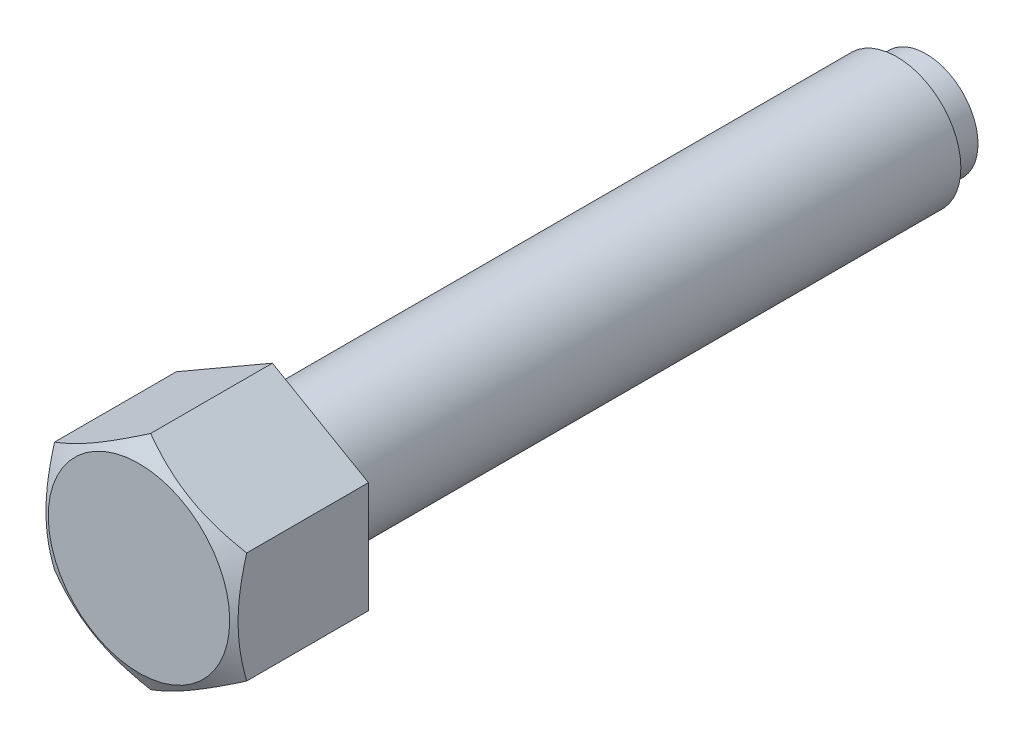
ISO-10303-21;
HEADER;
FILE_DESCRIPTION(('STEP AP214'),'2;1');
FILE_NAME('part.step','',(''),(''),'','','');
FILE_SCHEMA(('AUTOMOTIVE_DESIGN { 1 0 10303 214 1 1 1 1 }'));
ENDSEC;
DATA;
#1=APPLICATION_CONTEXT('core data for automotive mechanical design processes');
#2=APPLICATION_PROTOCOL_DEFINITION('international standard','automotive_design',2000,#1);
#3=PRODUCT_CONTEXT('',#1,'mechanical');
#4=PRODUCT('Part','Part','',(#3));
#5=PRODUCT_RELATED_PRODUCT_CATEGORY('part','',(#4));
#6=PRODUCT_DEFINITION_FORMATION('','',#4);
#7=PRODUCT_DEFINITION_CONTEXT('part definition',#1,'design');
#8=PRODUCT_DEFINITION('design','',#6,#7);
#9=PRODUCT_DEFINITION_SHAPE('','',#8);
#10=(LENGTH_UNIT() NAMED_UNIT(*) SI_UNIT(.MILLI.,.METRE.));
#11=(NAMED_UNIT(*) PLANE_ANGLE_UNIT() SI_UNIT($,.RADIAN.));
#12=(NAMED_UNIT(*) SI_UNIT($,.STERADIAN.) SOLID_ANGLE_UNIT());
#13=UNCERTAINTY_MEASURE_WITH_UNIT(LENGTH_MEASURE(1.E-05),#10,'distance_accuracy_value','');
#14=(GEOMETRIC_REPRESENTATION_CONTEXT(3) GLOBAL_UNCERTAINTY_ASSIGNED_CONTEXT((#13)) GLOBAL_UNIT_ASSIGNED_CONTEXT((#10,
#11,#12)) REPRESENTATION_CONTEXT('',''));
#15=CARTESIAN_POINT('',(0.,0.,0.));
#16=DIRECTION('',(0.,0.,1.));
#17=DIRECTION('',(1.,0.,0.));
#18=AXIS2_PLACEMENT_3D('',#15,#16,#17);
#19=CARTESIAN_POINT('',(0.,20.7846096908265,120.));
#20=DIRECTION('',(-0.5,-0.86602540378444,0.));
#21=DIRECTION('',(0.86602540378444,-0.5,0.));
#22=AXIS2_PLACEMENT_3D('',#19,#20,#21);
#23=PLANE('',#22);
#24=CARTESIAN_POINT('',(18.0002,10.3921893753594,147.814887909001));
#25=CARTESIAN_POINT('',(17.6045674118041,10.6206079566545,147.946756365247));
#26=CARTESIAN_POINT('',(17.2073916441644,10.8499174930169,148.072640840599));
#27=CARTESIAN_POINT('',(16.4098552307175,11.310375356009,148.310778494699));
#28=CARTESIAN_POINT('',(16.0094935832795,11.5415242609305,148.423027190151));
#29=CARTESIAN_POINT('',(15.2048116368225,12.0061075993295,148.632384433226));
#30=CARTESIAN_POINT('',(14.8004842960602,12.2395460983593,148.729457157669));
#31=CARTESIAN_POINT('',(13.9890201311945,12.7080451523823,148.906377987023));
#32=CARTESIAN_POINT('',(13.5818834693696,12.9431056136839,148.98622707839));
#33=CARTESIAN_POINT('',(12.7752328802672,13.4088255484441,149.125304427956));
#34=CARTESIAN_POINT('',(12.3757788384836,13.6394504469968,149.184993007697));
#35=CARTESIAN_POINT('',(11.5750403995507,14.1017570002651,149.285077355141));
#36=CARTESIAN_POINT('',(11.1737559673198,14.3334386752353,149.325472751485));
#37=CARTESIAN_POINT('',(10.370513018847,14.7971912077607,149.385950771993));
#38=CARTESIAN_POINT('',(9.96855587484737,15.0292612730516,149.406057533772));
#39=CARTESIAN_POINT('',(9.16427056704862,15.4936156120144,149.425525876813));
#40=CARTESIAN_POINT('',(8.76194241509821,15.7258998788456,149.424888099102));
#41=CARTESIAN_POINT('',(8.00978065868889,16.1601606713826,149.404316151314));
#42=CARTESIAN_POINT('',(7.65989346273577,16.3621681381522,149.38689054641));
#43=CARTESIAN_POINT('',(6.96095368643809,16.765701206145,149.336680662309));
#44=CARTESIAN_POINT('',(6.61190109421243,16.9672268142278,149.303896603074));
#45=CARTESIAN_POINT('',(5.91476277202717,17.3697198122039,149.223538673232));
#46=CARTESIAN_POINT('',(5.56667820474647,17.5706865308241,149.175951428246));
#47=CARTESIAN_POINT('',(4.87216610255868,17.9716632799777,149.066826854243));
#48=CARTESIAN_POINT('',(4.52573856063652,18.1716733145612,149.005289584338));
#49=CARTESIAN_POINT('',(3.47411308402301,18.7788295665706,148.798187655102));
#50=CARTESIAN_POINT('',(2.77196054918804,19.1842175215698,148.631972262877));
#51=CARTESIAN_POINT('',(1.37812528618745,19.9889486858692,148.254731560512));
#52=CARTESIAN_POINT('',(0.686424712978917,20.3883021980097,148.043794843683));
#53=CARTESIAN_POINT('',(-0.000199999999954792,20.7847251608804,147.814887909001));
#54=B_SPLINE_CURVE_WITH_KNOTS('',3,(#24,#25,#26,#27,#28,#29,#30,#31,#32,#33,#34,#35,#36,#37,#38,
#39,#40,#41,#42,#43,#44,#45,#46,#47,#48,#49,#50,#51,#52,#53),.UNSPECIFIED.,.F.,.F.,(4,2,2,2,2,2,
2,2,2,2,2,2,2,2,4),(0.,1.42650335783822,2.85347447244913,4.28376471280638,5.71397301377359,
7.10888071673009,8.50381526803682,9.89708828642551,11.2903182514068,12.5031974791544,
13.7160593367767,14.9300201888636,16.1439758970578,18.6253607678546,21.1018751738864),.UNSPECIFIED.);
#55=CARTESIAN_POINT('',(18.,10.3923048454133,147.814954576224));
#56=VERTEX_POINT('',#55);
#57=CARTESIAN_POINT('',(0.,20.7846096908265,147.814954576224));
#58=VERTEX_POINT('',#57);
#59=EDGE_CURVE('E29',#56,#58,#54,.T.);
#60=ORIENTED_EDGE('',*,*,#59,.F.);
#61=DIRECTION('',(0.,0.,1.));
#62=VECTOR('',#61,1.);
#63=CARTESIAN_POINT('',(18.,10.3923048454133,120.));
#64=LINE('',#63,#62);
#65=CARTESIAN_POINT('',(18.,10.3923048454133,125.));
#66=VERTEX_POINT('',#65);
#67=EDGE_CURVE('E96',#66,#56,#64,.T.);
#68=ORIENTED_EDGE('',*,*,#67,.F.);
#69=DIRECTION('',(0.86602540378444,-0.5,0.));
#70=VECTOR('',#69,1.);
#71=CARTESIAN_POINT('',(18.,10.3923048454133,125.));
#72=LINE('',#71,#70);
#73=CARTESIAN_POINT('',(0.,20.7846096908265,125.));
#74=VERTEX_POINT('',#73);
#75=EDGE_CURVE('E110',#74,#66,#72,.T.);
#76=ORIENTED_EDGE('',*,*,#75,.F.);
#77=DIRECTION('',(0.,0.,1.));
#78=VECTOR('',#77,1.);
#79=CARTESIAN_POINT('',(0.,20.7846096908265,120.));
#80=LINE('',#79,#78);
#81=EDGE_CURVE('E36',#74,#58,#80,.T.);
#82=ORIENTED_EDGE('',*,*,#81,.T.);
#83=EDGE_LOOP('',(#60,#68,#76,#82));
#84=FACE_BOUND('',#83,.T.);
#85=ADVANCED_FACE('F14',(#84),#23,.F.);
#86=CARTESIAN_POINT('',(18.,10.3923048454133,120.));
#87=DIRECTION('',(-1.,0.,0.));
#88=DIRECTION('',(0.,-1.,0.));
#89=AXIS2_PLACEMENT_3D('',#86,#87,#88);
#90=PLANE('',#89);
#91=CARTESIAN_POINT('',(18.,-27.7856705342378,140.700880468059));
#92=CARTESIAN_POINT('',(18.,-27.3931265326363,140.891087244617));
#93=CARTESIAN_POINT('',(18.,-27.00011837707,141.08033565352));
#94=CARTESIAN_POINT('',(18.,-26.2130768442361,141.456698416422));
#95=CARTESIAN_POINT('',(18.,-25.8190434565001,141.643812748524));
#96=CARTESIAN_POINT('',(18.,-24.6351533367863,142.201678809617));
#97=CARTESIAN_POINT('',(18.,-23.8436247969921,142.568896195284));
#98=CARTESIAN_POINT('',(18.,-22.2508574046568,143.293665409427));
#99=CARTESIAN_POINT('',(18.,-21.4495890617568,143.65115258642));
#100=CARTESIAN_POINT('',(18.,-19.8406345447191,144.351328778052));
#101=CARTESIAN_POINT('',(18.,-19.0329486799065,144.694018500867));
#102=CARTESIAN_POINT('',(18.,-17.384335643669,145.37116922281));
#103=CARTESIAN_POINT('',(18.,-16.5431617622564,145.705032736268));
#104=CARTESIAN_POINT('',(18.,-14.8509192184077,146.347178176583));
#105=CARTESIAN_POINT('',(18.,-13.9998494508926,146.655457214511));
#106=CARTESIAN_POINT('',(18.,-12.2881243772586,147.238241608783));
#107=CARTESIAN_POINT('',(18.,-11.4274929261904,147.512816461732));
#108=CARTESIAN_POINT('',(18.,-9.69380398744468,148.019311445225));
#109=CARTESIAN_POINT('',(18.,-8.82075054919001,148.251245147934));
#110=CARTESIAN_POINT('',(18.,-7.50411166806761,148.558078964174));
#111=CARTESIAN_POINT('',(18.,-7.0652351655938,148.653312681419));
#112=CARTESIAN_POINT('',(18.,-6.18450790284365,148.828942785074));
#113=CARTESIAN_POINT('',(18.,-5.74265720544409,148.909339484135));
#114=CARTESIAN_POINT('',(18.,-4.85630346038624,149.053867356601));
#115=CARTESIAN_POINT('',(18.,-4.41180049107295,149.117999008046));
#116=CARTESIAN_POINT('',(18.,-3.52059947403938,149.228716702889));
#117=CARTESIAN_POINT('',(18.,-3.07390142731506,149.275302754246));
#118=CARTESIAN_POINT('',(18.,-2.18473533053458,149.34942269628));
#119=CARTESIAN_POINT('',(18.,-1.7422872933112,149.377195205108));
#120=CARTESIAN_POINT('',(18.,-0.856614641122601,149.414013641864));
#121=CARTESIAN_POINT('',(18.,-0.413390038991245,149.423059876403));
#122=CARTESIAN_POINT('',(18.,0.473047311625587,149.422211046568));
#123=CARTESIAN_POINT('',(18.,0.916260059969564,149.412315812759));
#124=CARTESIAN_POINT('',(18.,1.80187706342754,149.373823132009));
#125=CARTESIAN_POINT('',(18.,2.24428128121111,149.34522484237));
#126=CARTESIAN_POINT('',(18.,3.31144318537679,149.254283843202));
#127=CARTESIAN_POINT('',(18.,3.93543941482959,149.182849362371));
#128=CARTESIAN_POINT('',(18.,5.17871898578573,149.006693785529));
#129=CARTESIAN_POINT('',(18.,5.79800165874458,148.901968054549));
#130=CARTESIAN_POINT('',(18.,7.03129105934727,148.662955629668));
#131=CARTESIAN_POINT('',(18.,7.64529320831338,148.528645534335));
#132=CARTESIAN_POINT('',(18.,8.86709871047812,148.234555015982));
#133=CARTESIAN_POINT('',(18.,9.4749021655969,148.074775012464));
#134=CARTESIAN_POINT('',(18.,10.6976432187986,147.729857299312));
#135=CARTESIAN_POINT('',(18.,11.3124445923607,147.544239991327));
#136=CARTESIAN_POINT('',(18.,12.5359892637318,147.154110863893));
#137=CARTESIAN_POINT('',(18.,13.1447325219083,146.949598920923));
#138=CARTESIAN_POINT('',(18.,14.3564672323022,146.524902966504));
#139=CARTESIAN_POINT('',(18.,14.9594605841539,146.30472434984));
#140=CARTESIAN_POINT('',(18.,16.1604691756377,145.851257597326));
#141=CARTESIAN_POINT('',(18.,16.7584844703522,145.617969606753));
#142=CARTESIAN_POINT('',(18.,18.1568432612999,145.05762073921));
#143=CARTESIAN_POINT('',(18.,18.9553996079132,144.726106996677));
#144=CARTESIAN_POINT('',(18.,20.5458499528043,144.047421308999));
#145=CARTESIAN_POINT('',(18.,21.3377435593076,143.700248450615));
#146=CARTESIAN_POINT('',(18.,22.9160943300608,142.993347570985));
#147=CARTESIAN_POINT('',(18.,23.7025503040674,142.633616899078));
#148=CARTESIAN_POINT('',(18.,25.2707564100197,141.904105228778));
#149=CARTESIAN_POINT('',(18.,26.0525066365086,141.534324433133));
#150=CARTESIAN_POINT('',(18.,27.6128949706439,140.786178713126));
#151=CARTESIAN_POINT('',(18.,28.3915289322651,140.407805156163));
#152=CARTESIAN_POINT('',(18.,29.9454784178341,139.644305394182));
#153=CARTESIAN_POINT('',(18.,30.7207939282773,139.259179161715));
#154=CARTESIAN_POINT('',(18.,32.268519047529,138.483366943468));
#155=CARTESIAN_POINT('',(18.,33.0409289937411,138.092681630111));
#156=CARTESIAN_POINT('',(18.,34.5833483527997,137.306608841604));
#157=CARTESIAN_POINT('',(18.,35.3533577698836,136.911221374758));
#158=CARTESIAN_POINT('',(18.,37.5335490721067,135.784627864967));
#159=CARTESIAN_POINT('',(18.,38.9413093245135,135.04873549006));
#160=CARTESIAN_POINT('',(18.,41.7516137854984,133.566967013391));
#161=CARTESIAN_POINT('',(18.,43.1541578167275,132.821090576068));
#162=CARTESIAN_POINT('',(18.,45.9517810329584,131.323480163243));
#163=CARTESIAN_POINT('',(18.,47.346870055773,130.571764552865));
#164=CARTESIAN_POINT('',(18.,49.4370372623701,129.439730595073));
#165=CARTESIAN_POINT('',(18.,50.133330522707,129.06165241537));
#166=CARTESIAN_POINT('',(18.,51.5251871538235,128.304157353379));
#167=CARTESIAN_POINT('',(18.,52.2207505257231,127.924740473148));
#168=CARTESIAN_POINT('',(18.,52.91599004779,127.544730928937));
#169=B_SPLINE_CURVE_WITH_KNOTS('',3,(#91,#92,#93,#94,#95,#96,#97,#98,#99,#100,#101,#102,#103,
#104,#105,#106,#107,#108,#109,#110,#111,#112,#113,#114,#115,#116,#117,#118,#119,#120,#121,#122,
#123,#124,#125,#126,#127,#128,#129,#130,#131,#132,#133,#134,#135,#136,#137,#138,#139,#140,#141,
#142,#143,#144,#145,#146,#147,#148,#149,#150,#151,#152,#153,#154,#155,#156,#157,#158,#159,#160,
#161,#162,#163,#164,#165,#166,#167,#168),.UNSPECIFIED.,.F.,.F.,(4,2,2,2,2,2,2,2,2,2,2,2,2,2,2,2,
2,2,2,2,2,2,2,2,2,2,2,2,2,2,2,2,2,2,2,2,2,2,4),(0.,1.30859404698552,2.61720150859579,
5.23481048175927,7.86688932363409,10.4988420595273,13.2135464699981,15.9285570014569,
18.6378717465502,21.3463226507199,22.6933831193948,24.0404151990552,25.3874076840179,
26.7343995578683,28.0639701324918,29.3935189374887,30.7230796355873,32.0527002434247,
33.9358707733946,35.8193036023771,37.7042316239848,39.5891286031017,41.5153969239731,
43.4416778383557,45.3672986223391,47.2928980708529,49.8865774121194,52.4804082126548,
55.0747898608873,57.6691192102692,60.2661815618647,62.8632544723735,65.4600158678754,
68.0567726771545,72.822206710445,77.5878013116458,82.3419530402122,84.7189051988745,
87.0958537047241),.UNSPECIFIED.);
#170=CARTESIAN_POINT('',(18.,-10.3923048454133,147.814954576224));
#171=VERTEX_POINT('',#170);
#172=EDGE_CURVE('E156',#171,#56,#169,.T.);
#173=ORIENTED_EDGE('',*,*,#172,.F.);
#174=DIRECTION('',(0.,0.,1.));
#175=VECTOR('',#174,1.);
#176=CARTESIAN_POINT('',(18.,-10.3923048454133,120.));
#177=LINE('',#176,#175);
#178=CARTESIAN_POINT('',(18.,-10.3923048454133,125.));
#179=VERTEX_POINT('',#178);
#180=EDGE_CURVE('E93',#179,#171,#177,.T.);
#181=ORIENTED_EDGE('',*,*,#180,.F.);
#182=DIRECTION('',(0.,-1.,0.));
#183=VECTOR('',#182,1.);
#184=CARTESIAN_POINT('',(18.,0.,125.));
#185=LINE('',#184,#183);
#186=EDGE_CURVE('E107',#66,#179,#185,.T.);
#187=ORIENTED_EDGE('',*,*,#186,.F.);
#188=ORIENTED_EDGE('',*,*,#67,.T.);
#189=EDGE_LOOP('',(#173,#181,#187,#188));
#190=FACE_BOUND('',#189,.T.);
#191=ADVANCED_FACE('F136',(#190),#90,.F.);
#192=CARTESIAN_POINT('',(0.,-20.7846096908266,120.));
#193=DIRECTION('',(0.5,-0.866025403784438,0.));
#194=DIRECTION('',(0.866025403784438,0.5,0.));
#195=AXIS2_PLACEMENT_3D('',#192,#193,#194);
#196=PLANE('',#195);
#197=ORIENTED_EDGE('',*,*,#180,.T.);
#198=CARTESIAN_POINT('',(18.0002,-10.3921893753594,147.814887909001));
#199=CARTESIAN_POINT('',(17.6045674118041,-10.6206079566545,147.946756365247));
#200=CARTESIAN_POINT('',(17.2073916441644,-10.8499174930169,148.072640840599));
#201=CARTESIAN_POINT('',(16.4098552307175,-11.310375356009,148.310778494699));
#202=CARTESIAN_POINT('',(16.0094935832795,-11.5415242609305,148.423027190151));
#203=CARTESIAN_POINT('',(15.2048116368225,-12.0061075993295,148.632384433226));
#204=CARTESIAN_POINT('',(14.8004842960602,-12.2395460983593,148.729457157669));
#205=CARTESIAN_POINT('',(13.9890201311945,-12.7080451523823,148.906377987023));
#206=CARTESIAN_POINT('',(13.5818834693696,-12.9431056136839,148.98622707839));
#207=CARTESIAN_POINT('',(12.7752328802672,-13.4088255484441,149.125304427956));
#208=CARTESIAN_POINT('',(12.3757788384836,-13.6394504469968,149.184993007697));
#209=CARTESIAN_POINT('',(11.5750403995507,-14.1017570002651,149.285077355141));
#210=CARTESIAN_POINT('',(11.1737559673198,-14.3334386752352,149.325472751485));
#211=CARTESIAN_POINT('',(10.370513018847,-14.7971912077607,149.385950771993));
#212=CARTESIAN_POINT('',(9.96855587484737,-15.0292612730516,149.406057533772));
#213=CARTESIAN_POINT('',(9.16427056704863,-15.4936156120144,149.425525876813));
#214=CARTESIAN_POINT('',(8.76194241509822,-15.7258998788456,149.424888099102));
#215=CARTESIAN_POINT('',(8.0097806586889,-16.1601606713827,149.404316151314));
#216=CARTESIAN_POINT('',(7.65989346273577,-16.3621681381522,149.38689054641));
#217=CARTESIAN_POINT('',(6.96095368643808,-16.765701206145,149.336680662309));
#218=CARTESIAN_POINT('',(6.61190109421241,-16.9672268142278,149.303896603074));
#219=CARTESIAN_POINT('',(5.91476277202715,-17.3697198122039,149.223538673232));
#220=CARTESIAN_POINT('',(5.56667820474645,-17.5706865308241,149.175951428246));
#221=CARTESIAN_POINT('',(4.87216610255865,-17.9716632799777,149.066826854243));
#222=CARTESIAN_POINT('',(4.52573856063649,-18.1716733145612,149.005289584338));
#223=CARTESIAN_POINT('',(3.47411308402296,-18.7788295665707,148.798187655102));
#224=CARTESIAN_POINT('',(2.77196054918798,-19.1842175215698,148.631972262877));
#225=CARTESIAN_POINT('',(1.37812528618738,-19.9889486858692,148.254731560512));
#226=CARTESIAN_POINT('',(0.686424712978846,-20.3883021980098,148.043794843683));
#227=CARTESIAN_POINT('',(-0.000200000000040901,-20.7847251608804,147.814887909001));
#228=B_SPLINE_CURVE_WITH_KNOTS('',3,(#198,#199,#200,#201,#202,#203,#204,#205,#206,#207,#208,
#209,#210,#211,#212,#213,#214,#215,#216,#217,#218,#219,#220,#221,#222,#223,#224,#225,#226,#227),
.UNSPECIFIED.,.F.,.F.,(4,2,2,2,2,2,2,2,2,2,2,2,2,2,4),(0.,1.42650335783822,2.85347447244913,
4.28376471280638,5.71397301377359,7.10888071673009,8.50381526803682,9.89708828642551,
11.2903182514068,12.5031974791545,13.7160593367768,14.9300201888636,16.1439758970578,
18.6253607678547,21.1018751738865),.UNSPECIFIED.);
#229=CARTESIAN_POINT('',(0.,-20.7846096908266,147.814954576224));
#230=VERTEX_POINT('',#229);
#231=EDGE_CURVE('E162',#171,#230,#228,.T.);
#232=ORIENTED_EDGE('',*,*,#231,.T.);
#233=DIRECTION('',(0.,0.,1.));
#234=VECTOR('',#233,1.);
#235=CARTESIAN_POINT('',(0.,-20.7846096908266,120.));
#236=LINE('',#235,#234);
#237=CARTESIAN_POINT('',(0.,-20.7846096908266,125.));
#238=VERTEX_POINT('',#237);
#239=EDGE_CURVE('E86',#238,#230,#236,.T.);
#240=ORIENTED_EDGE('',*,*,#239,.F.);
#241=DIRECTION('',(0.866025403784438,0.5,0.));
#242=VECTOR('',#241,1.);
#243=CARTESIAN_POINT('',(18.,-10.3923048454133,125.));
#244=LINE('',#243,#242);
#245=EDGE_CURVE('E105',#238,#179,#244,.T.);
#246=ORIENTED_EDGE('',*,*,#245,.T.);
#247=EDGE_LOOP('',(#197,#232,#240,#246));
#248=FACE_BOUND('',#247,.T.);
#249=ADVANCED_FACE('F142',(#248),#196,.T.);
#250=CARTESIAN_POINT('',(0.,-20.7846096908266,120.));
#251=DIRECTION('',(0.5,0.866025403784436,0.));
#252=DIRECTION('',(-0.866025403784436,0.5,0.));
#253=AXIS2_PLACEMENT_3D('',#250,#251,#252);
#254=PLANE('',#253);
#255=CARTESIAN_POINT('',(-18.0002,-10.3921893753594,147.814887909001));
#256=CARTESIAN_POINT('',(-17.6045674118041,-10.6206079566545,147.946756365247));
#257=CARTESIAN_POINT('',(-17.2073916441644,-10.8499174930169,148.072640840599));
#258=CARTESIAN_POINT('',(-16.4098552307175,-11.310375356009,148.310778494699));
#259=CARTESIAN_POINT('',(-16.0094935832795,-11.5415242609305,148.423027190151));
#260=CARTESIAN_POINT('',(-15.2048116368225,-12.0061075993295,148.632384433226));
#261=CARTESIAN_POINT('',(-14.8004842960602,-12.2395460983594,148.729457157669));
#262=CARTESIAN_POINT('',(-13.9890201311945,-12.7080451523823,148.906377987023));
#263=CARTESIAN_POINT('',(-13.5818834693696,-12.9431056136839,148.98622707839));
#264=CARTESIAN_POINT('',(-12.7752328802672,-13.4088255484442,149.125304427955));
#265=CARTESIAN_POINT('',(-12.3757788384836,-13.6394504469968,149.184993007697));
#266=CARTESIAN_POINT('',(-11.5750403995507,-14.1017570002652,149.285077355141));
#267=CARTESIAN_POINT('',(-11.1737559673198,-14.3334386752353,149.325472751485));
#268=CARTESIAN_POINT('',(-10.3705130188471,-14.7971912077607,149.385950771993));
#269=CARTESIAN_POINT('',(-9.96855587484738,-15.0292612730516,149.406057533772));
#270=CARTESIAN_POINT('',(-9.16427056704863,-15.4936156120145,149.425525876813));
#271=CARTESIAN_POINT('',(-8.76194241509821,-15.7258998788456,149.424888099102));
#272=CARTESIAN_POINT('',(-8.00978065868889,-16.1601606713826,149.404316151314));
#273=CARTESIAN_POINT('',(-7.65989346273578,-16.3621681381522,149.38689054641));
#274=CARTESIAN_POINT('',(-6.9609536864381,-16.765701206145,149.336680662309));
#275=CARTESIAN_POINT('',(-6.61190109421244,-16.9672268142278,149.303896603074));
#276=CARTESIAN_POINT('',(-5.91476277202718,-17.3697198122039,149.223538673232));
#277=CARTESIAN_POINT('',(-5.56667820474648,-17.5706865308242,149.175951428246));
#278=CARTESIAN_POINT('',(-4.87216610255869,-17.9716632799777,149.066826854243));
#279=CARTESIAN_POINT('',(-4.52573856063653,-18.1716733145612,149.005289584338));
#280=CARTESIAN_POINT('',(-3.47411308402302,-18.7788295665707,148.798187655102));
#281=CARTESIAN_POINT('',(-2.77196054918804,-19.1842175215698,148.631972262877));
#282=CARTESIAN_POINT('',(-1.37812528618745,-19.9889486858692,148.254731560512));
#283=CARTESIAN_POINT('',(-0.686424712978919,-20.3883021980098,148.043794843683));
#284=CARTESIAN_POINT('',(0.000199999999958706,-20.7847251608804,147.814887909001));
#285=B_SPLINE_CURVE_WITH_KNOTS('',3,(#255,#256,#257,#258,#259,#260,#261,#262,#263,#264,#265,
#266,#267,#268,#269,#270,#271,#272,#273,#274,#275,#276,#277,#278,#279,#280,#281,#282,#283,#284),
.UNSPECIFIED.,.F.,.F.,(4,2,2,2,2,2,2,2,2,2,2,2,2,2,4),(0.,1.42650335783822,2.85347447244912,
4.28376471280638,5.71397301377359,7.10888071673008,8.50381526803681,9.8970882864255,
11.2903182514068,12.5031974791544,13.7160593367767,14.9300201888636,16.1439758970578,
18.6253607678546,21.1018751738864),.UNSPECIFIED.);
#286=CARTESIAN_POINT('',(-18.,-10.3923048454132,147.814954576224));
#287=VERTEX_POINT('',#286);
#288=EDGE_CURVE('E80',#287,#230,#285,.T.);
#289=ORIENTED_EDGE('',*,*,#288,.F.);
#290=DIRECTION('',(0.,0.,1.));
#291=VECTOR('',#290,1.);
#292=CARTESIAN_POINT('',(-18.,-10.3923048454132,120.));
#293=LINE('',#292,#291);
#294=CARTESIAN_POINT('',(-18.,-10.3923048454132,125.));
#295=VERTEX_POINT('',#294);
#296=EDGE_CURVE('E79',#295,#287,#293,.T.);
#297=ORIENTED_EDGE('',*,*,#296,.F.);
#298=DIRECTION('',(-0.866025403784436,0.5,0.));
#299=VECTOR('',#298,1.);
#300=CARTESIAN_POINT('',(-1.33573707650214E-13,-20.7846096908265,125.));
#301=LINE('',#300,#299);
#302=EDGE_CURVE('E102',#238,#295,#301,.T.);
#303=ORIENTED_EDGE('',*,*,#302,.F.);
#304=ORIENTED_EDGE('',*,*,#239,.T.);
#305=EDGE_LOOP('',(#289,#297,#303,#304));
#306=FACE_BOUND('',#305,.T.);
#307=ADVANCED_FACE('F238',(#306),#254,.F.);
#308=CARTESIAN_POINT('',(-18.,10.3923048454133,120.));
#309=DIRECTION('',(-1.,0.,0.));
#310=DIRECTION('',(0.,0.,1.));
#311=AXIS2_PLACEMENT_3D('',#308,#309,#310);
#312=PLANE('',#311);
#313=ORIENTED_EDGE('',*,*,#296,.T.);
#314=CARTESIAN_POINT('',(-18.,-27.7856705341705,140.700880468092));
#315=CARTESIAN_POINT('',(-18.,-27.3931265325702,140.891087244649));
#316=CARTESIAN_POINT('',(-18.,-27.000118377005,141.080335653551));
#317=CARTESIAN_POINT('',(-18.,-26.2130768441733,141.456698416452));
#318=CARTESIAN_POINT('',(-18.,-25.8190434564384,141.643812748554));
#319=CARTESIAN_POINT('',(-18.,-24.635153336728,142.201678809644));
#320=CARTESIAN_POINT('',(-18.,-23.8436247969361,142.56889619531));
#321=CARTESIAN_POINT('',(-18.,-22.2508574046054,143.29366540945));
#322=CARTESIAN_POINT('',(-18.,-21.4495890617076,143.651152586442));
#323=CARTESIAN_POINT('',(-18.,-19.8406345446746,144.351328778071));
#324=CARTESIAN_POINT('',(-18.,-19.0329486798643,144.694018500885));
#325=CARTESIAN_POINT('',(-18.,-17.3843356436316,145.371169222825));
#326=CARTESIAN_POINT('',(-18.,-16.5431617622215,145.705032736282));
#327=CARTESIAN_POINT('',(-18.,-14.8509192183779,146.347178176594));
#328=CARTESIAN_POINT('',(-18.,-13.9998494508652,146.65545721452));
#329=CARTESIAN_POINT('',(-18.,-12.2881243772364,147.23824160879));
#330=CARTESIAN_POINT('',(-18.,-11.4274929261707,147.512816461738));
#331=CARTESIAN_POINT('',(-18.,-9.69380398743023,148.019311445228));
#332=CARTESIAN_POINT('',(-18.,-8.82075054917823,148.251245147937));
#333=CARTESIAN_POINT('',(-18.,-7.50411166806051,148.558078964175));
#334=CARTESIAN_POINT('',(-18.,-7.0652351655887,148.65331268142));
#335=CARTESIAN_POINT('',(-18.,-6.1845079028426,148.828942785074));
#336=CARTESIAN_POINT('',(-18.,-5.74265720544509,148.909339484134));
#337=CARTESIAN_POINT('',(-18.,-4.85630346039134,149.0538673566));
#338=CARTESIAN_POINT('',(-18.,-4.41180049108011,149.117999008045));
#339=CARTESIAN_POINT('',(-18.,-3.52059947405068,149.228716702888));
#340=CARTESIAN_POINT('',(-18.,-3.07390142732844,149.275302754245));
#341=CARTESIAN_POINT('',(-18.,-2.18473533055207,149.349422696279));
#342=CARTESIAN_POINT('',(-18.,-1.74228729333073,149.377195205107));
#343=CARTESIAN_POINT('',(-18.,-0.856614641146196,149.414013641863));
#344=CARTESIAN_POINT('',(-18.,-0.413390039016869,149.423059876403));
#345=CARTESIAN_POINT('',(-18.,0.473047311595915,149.422211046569));
#346=CARTESIAN_POINT('',(-18.,0.916260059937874,149.41231581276));
#347=CARTESIAN_POINT('',(-18.,1.80187706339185,149.373823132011));
#348=CARTESIAN_POINT('',(-18.,2.24428128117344,149.345224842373));
#349=CARTESIAN_POINT('',(-18.,3.31144318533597,149.254283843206));
#350=CARTESIAN_POINT('',(-18.,3.93543941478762,149.182849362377));
#351=CARTESIAN_POINT('',(-18.,5.17871898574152,149.006693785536));
#352=CARTESIAN_POINT('',(-18.,5.79800165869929,148.901968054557));
#353=CARTESIAN_POINT('',(-18.,7.03129105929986,148.662955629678));
#354=CARTESIAN_POINT('',(-18.,7.64529320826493,148.528645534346));
#355=CARTESIAN_POINT('',(-18.,8.86709871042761,148.234555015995));
#356=CARTESIAN_POINT('',(-18.,9.47490216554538,148.074775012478));
#357=CARTESIAN_POINT('',(-18.,10.697643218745,147.729857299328));
#358=CARTESIAN_POINT('',(-18.,11.312444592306,147.544239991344));
#359=CARTESIAN_POINT('',(-18.,12.5359892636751,147.154110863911));
#360=CARTESIAN_POINT('',(-18.,13.1447325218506,146.949598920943));
#361=CARTESIAN_POINT('',(-18.,14.3564672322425,146.524902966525));
#362=CARTESIAN_POINT('',(-18.,14.9594605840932,146.304724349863));
#363=CARTESIAN_POINT('',(-18.,16.1604691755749,145.851257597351));
#364=CARTESIAN_POINT('',(-18.,16.7584844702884,145.617969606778));
#365=CARTESIAN_POINT('',(-18.,18.1568432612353,145.057620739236));
#366=CARTESIAN_POINT('',(-18.,18.9553996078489,144.726106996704));
#367=CARTESIAN_POINT('',(-18.,20.5458499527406,144.047421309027));
#368=CARTESIAN_POINT('',(-18.,21.3377435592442,143.700248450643));
#369=CARTESIAN_POINT('',(-18.,22.9160943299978,142.993347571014));
#370=CARTESIAN_POINT('',(-18.,23.7025503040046,142.633616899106));
#371=CARTESIAN_POINT('',(-18.,25.2707564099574,141.904105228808));
#372=CARTESIAN_POINT('',(-18.,26.0525066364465,141.534324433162));
#373=CARTESIAN_POINT('',(-18.,27.6128949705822,140.786178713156));
#374=CARTESIAN_POINT('',(-18.,28.3915289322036,140.407805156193));
#375=CARTESIAN_POINT('',(-18.,29.945478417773,139.644305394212));
#376=CARTESIAN_POINT('',(-18.,30.7207939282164,139.259179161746));
#377=CARTESIAN_POINT('',(-18.,32.2685190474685,138.483366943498));
#378=CARTESIAN_POINT('',(-18.,33.0409289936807,138.092681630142));
#379=CARTESIAN_POINT('',(-18.,34.5833483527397,137.306608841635));
#380=CARTESIAN_POINT('',(-18.,35.3533577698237,136.911221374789));
#381=CARTESIAN_POINT('',(-18.,37.533549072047,135.784627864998));
#382=CARTESIAN_POINT('',(-18.,38.9413093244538,135.048735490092));
#383=CARTESIAN_POINT('',(-18.,41.7516137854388,133.566967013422));
#384=CARTESIAN_POINT('',(-18.,43.1541578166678,132.8210905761));
#385=CARTESIAN_POINT('',(-18.,45.9517810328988,131.323480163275));
#386=CARTESIAN_POINT('',(-18.,47.3468700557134,130.571764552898));
#387=CARTESIAN_POINT('',(-18.,49.4370372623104,129.439730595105));
#388=CARTESIAN_POINT('',(-18.,50.1333305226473,129.061652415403));
#389=CARTESIAN_POINT('',(-18.,51.5251871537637,128.304157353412));
#390=CARTESIAN_POINT('',(-18.,52.2207505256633,127.92474047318));
#391=CARTESIAN_POINT('',(-18.,52.9159900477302,127.544730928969));
#392=B_SPLINE_CURVE_WITH_KNOTS('',3,(#314,#315,#316,#317,#318,#319,#320,#321,#322,#323,#324,
#325,#326,#327,#328,#329,#330,#331,#332,#333,#334,#335,#336,#337,#338,#339,#340,#341,#342,#343,
#344,#345,#346,#347,#348,#349,#350,#351,#352,#353,#354,#355,#356,#357,#358,#359,#360,#361,#362,
#363,#364,#365,#366,#367,#368,#369,#370,#371,#372,#373,#374,#375,#376,#377,#378,#379,#380,#381,
#382,#383,#384,#385,#386,#387,#388,#389,#390,#391),.UNSPECIFIED.,.F.,.F.,(4,2,2,2,2,2,2,2,2,2,2,
2,2,2,2,2,2,2,2,2,2,2,2,2,2,2,2,2,2,2,2,2,2,2,2,2,2,2,4),(0.,1.30859404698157,2.61720150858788,
5.23481048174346,7.86688932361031,10.4988420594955,13.2135464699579,15.9285570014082,
18.6378717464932,21.3463226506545,22.6933831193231,24.0404151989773,25.3874076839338,
26.734399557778,28.0639701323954,29.3935189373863,30.7230796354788,32.0527002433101,
33.9358707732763,35.8193036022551,37.7042316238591,39.5891286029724,41.5153969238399,
43.4416778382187,45.3672986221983,47.2928980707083,49.8865774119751,52.4804082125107,
55.0747898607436,57.6691192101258,60.2661815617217,62.8632544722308,65.460015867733,
68.0567726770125,72.8222067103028,77.5878013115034,82.3419530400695,84.7189051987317,
87.095853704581),.UNSPECIFIED.);
#393=CARTESIAN_POINT('',(-18.,10.3923048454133,147.814954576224));
#394=VERTEX_POINT('',#393);
#395=EDGE_CURVE('E67',#287,#394,#392,.T.);
#396=ORIENTED_EDGE('',*,*,#395,.T.);
#397=DIRECTION('',(0.,0.,1.));
#398=VECTOR('',#397,1.);
#399=CARTESIAN_POINT('',(-18.,10.3923048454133,120.));
#400=LINE('',#399,#398);
#401=CARTESIAN_POINT('',(-18.,10.3923048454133,125.));
#402=VERTEX_POINT('',#401);
#403=EDGE_CURVE('E76',#402,#394,#400,.T.);
#404=ORIENTED_EDGE('',*,*,#403,.F.);
#405=DIRECTION('',(0.,-1.,0.));
#406=VECTOR('',#405,1.);
#407=CARTESIAN_POINT('',(-18.,0.,125.));
#408=LINE('',#407,#406);
#409=EDGE_CURVE('E100',#402,#295,#408,.T.);
#410=ORIENTED_EDGE('',*,*,#409,.T.);
#411=EDGE_LOOP('',(#313,#396,#404,#410));
#412=FACE_BOUND('',#411,.T.);
#413=ADVANCED_FACE('F75',(#412),#312,.T.);
#414=CARTESIAN_POINT('',(0.,20.7846096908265,120.));
#415=DIRECTION('',(-0.5,0.866025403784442,0.));
#416=DIRECTION('',(-0.866025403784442,-0.5,0.));
#417=AXIS2_PLACEMENT_3D('',#414,#415,#416);
#418=PLANE('',#417);
#419=ORIENTED_EDGE('',*,*,#403,.T.);
#420=CARTESIAN_POINT('',(-18.0002,10.3921893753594,147.814887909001));
#421=CARTESIAN_POINT('',(-17.6045674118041,10.6206079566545,147.946756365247));
#422=CARTESIAN_POINT('',(-17.2073916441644,10.8499174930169,148.072640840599));
#423=CARTESIAN_POINT('',(-16.4098552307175,11.310375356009,148.310778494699));
#424=CARTESIAN_POINT('',(-16.0094935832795,11.5415242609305,148.423027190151));
#425=CARTESIAN_POINT('',(-15.2048116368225,12.0061075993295,148.632384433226));
#426=CARTESIAN_POINT('',(-14.8004842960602,12.2395460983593,148.729457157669));
#427=CARTESIAN_POINT('',(-13.9890201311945,12.7080451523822,148.906377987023));
#428=CARTESIAN_POINT('',(-13.5818834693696,12.9431056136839,148.98622707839));
#429=CARTESIAN_POINT('',(-12.7752328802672,13.4088255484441,149.125304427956));
#430=CARTESIAN_POINT('',(-12.3757788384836,13.6394504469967,149.184993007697));
#431=CARTESIAN_POINT('',(-11.5750403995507,14.1017570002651,149.285077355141));
#432=CARTESIAN_POINT('',(-11.1737559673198,14.3334386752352,149.325472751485));
#433=CARTESIAN_POINT('',(-10.370513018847,14.7971912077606,149.385950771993));
#434=CARTESIAN_POINT('',(-9.96855587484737,15.0292612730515,149.406057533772));
#435=CARTESIAN_POINT('',(-9.16427056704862,15.4936156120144,149.425525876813));
#436=CARTESIAN_POINT('',(-8.76194241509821,15.7258998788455,149.424888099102));
#437=CARTESIAN_POINT('',(-8.00978065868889,16.1601606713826,149.404316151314));
#438=CARTESIAN_POINT('',(-7.65989346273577,16.3621681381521,149.38689054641));
#439=CARTESIAN_POINT('',(-6.96095368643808,16.7657012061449,149.336680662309));
#440=CARTESIAN_POINT('',(-6.61190109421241,16.9672268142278,149.303896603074));
#441=CARTESIAN_POINT('',(-5.91476277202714,17.3697198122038,149.223538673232));
#442=CARTESIAN_POINT('',(-5.56667820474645,17.5706865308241,149.175951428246));
#443=CARTESIAN_POINT('',(-4.87216610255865,17.9716632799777,149.066826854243));
#444=CARTESIAN_POINT('',(-4.52573856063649,18.1716733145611,149.005289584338));
#445=CARTESIAN_POINT('',(-3.47411308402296,18.7788295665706,148.798187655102));
#446=CARTESIAN_POINT('',(-2.77196054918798,19.1842175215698,148.631972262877));
#447=CARTESIAN_POINT('',(-1.37812528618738,19.9889486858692,148.254731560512));
#448=CARTESIAN_POINT('',(-0.686424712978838,20.3883021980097,148.043794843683));
#449=CARTESIAN_POINT('',(0.000200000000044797,20.7847251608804,147.814887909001));
#450=B_SPLINE_CURVE_WITH_KNOTS('',3,(#420,#421,#422,#423,#424,#425,#426,#427,#428,#429,#430,
#431,#432,#433,#434,#435,#436,#437,#438,#439,#440,#441,#442,#443,#444,#445,#446,#447,#448,#449),
.UNSPECIFIED.,.F.,.F.,(4,2,2,2,2,2,2,2,2,2,2,2,2,2,4),(0.,1.42650335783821,2.85347447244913,
4.28376471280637,5.71397301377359,7.10888071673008,8.50381526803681,9.8970882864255,
11.2903182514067,12.5031974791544,13.7160593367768,14.9300201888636,16.1439758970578,
18.6253607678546,21.1018751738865),.UNSPECIFIED.);
#451=EDGE_CURVE('E64',#394,#58,#450,.T.);
#452=ORIENTED_EDGE('',*,*,#451,.T.);
#453=ORIENTED_EDGE('',*,*,#81,.F.);
#454=DIRECTION('',(-0.866025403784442,-0.5,0.));
#455=VECTOR('',#454,1.);
#456=CARTESIAN_POINT('',(1.47451495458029E-13,20.7846096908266,125.));
#457=LINE('',#456,#455);
#458=EDGE_CURVE('E84',#74,#402,#457,.T.);
#459=ORIENTED_EDGE('',*,*,#458,.T.);
#460=EDGE_LOOP('',(#419,#452,#453,#459));
#461=FACE_BOUND('',#460,.T.);
#462=ADVANCED_FACE('F82',(#461),#418,.T.);
#463=CARTESIAN_POINT('',(0.,0.,20.));
#464=DIRECTION('',(0.,0.,1.));
#465=DIRECTION('',(1.,0.,0.));
#466=AXIS2_PLACEMENT_3D('',#463,#464,#465);
#467=SPHERICAL_SURFACE('',#466,20.);
#468=CARTESIAN_POINT('',(0.,0.,2.53754026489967));
#469=DIRECTION('',(0.,0.,1.));
#470=DIRECTION('',(1.,0.,0.));
#471=AXIS2_PLACEMENT_3D('',#468,#469,#470);
#472=CIRCLE('',#471,9.75);
#473=CARTESIAN_POINT('',(9.75,0.,2.53754026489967));
#474=VERTEX_POINT('',#473);
#475=EDGE_CURVE('E9',#474,#474,#472,.T.);
#476=ORIENTED_EDGE('',*,*,#475,.F.);
#477=EDGE_LOOP('',(#476));
#478=FACE_BOUND('',#477,.T.);
#479=ADVANCED_FACE('F16',(#478),#467,.T.);
#480=CARTESIAN_POINT('',(0.,0.,110.));
#481=DIRECTION('',(0.,0.,1.));
#482=DIRECTION('',(1.,0.,0.));
#483=AXIS2_PLACEMENT_3D('',#480,#481,#482);
#484=CYLINDRICAL_SURFACE('',#483,9.75);
#485=ORIENTED_EDGE('',*,*,#475,.T.);
#486=EDGE_LOOP('',(#485));
#487=FACE_BOUND('',#486,.T.);
#488=CARTESIAN_POINT('',(0.,0.,8.));
#489=DIRECTION('',(0.,0.,1.));
#490=DIRECTION('',(1.,0.,0.));
#491=AXIS2_PLACEMENT_3D('',#488,#489,#490);
#492=CIRCLE('',#491,9.75);
#493=CARTESIAN_POINT('',(9.75,0.,8.));
#494=VERTEX_POINT('',#493);
#495=EDGE_CURVE('E22',#494,#494,#492,.T.);
#496=ORIENTED_EDGE('',*,*,#495,.F.);
#497=EDGE_LOOP('',(#496));
#498=FACE_BOUND('',#497,.T.);
#499=ADVANCED_FACE('F123',(#487,#498),#484,.T.);
#500=CARTESIAN_POINT('',(9.75,0.,8.));
#501=DIRECTION('',(0.,0.,1.));
#502=DIRECTION('',(1.,0.,0.));
#503=AXIS2_PLACEMENT_3D('',#500,#501,#502);
#504=PLANE('',#503);
#505=CARTESIAN_POINT('',(0.,0.,8.));
#506=DIRECTION('',(0.,0.,1.));
#507=DIRECTION('',(1.,0.,0.));
#508=AXIS2_PLACEMENT_3D('',#505,#506,#507);
#509=CIRCLE('',#508,12.);
#510=CARTESIAN_POINT('',(12.,0.,8.));
#511=VERTEX_POINT('',#510);
#512=EDGE_CURVE('E116',#511,#511,#509,.T.);
#513=ORIENTED_EDGE('',*,*,#512,.F.);
#514=EDGE_LOOP('',(#513));
#515=FACE_BOUND('',#514,.T.);
#516=ORIENTED_EDGE('',*,*,#495,.T.);
#517=EDGE_LOOP('',(#516));
#518=FACE_BOUND('',#517,.T.);
#519=ADVANCED_FACE('F121',(#515,#518),#504,.F.);
#520=CARTESIAN_POINT('',(0.,0.,110.));
#521=DIRECTION('',(0.,0.,1.));
#522=DIRECTION('',(1.,0.,0.));
#523=AXIS2_PLACEMENT_3D('',#520,#521,#522);
#524=CYLINDRICAL_SURFACE('',#523,12.);
#525=CARTESIAN_POINT('',(0.,0.,125.));
#526=DIRECTION('',(0.,0.,1.));
#527=DIRECTION('',(1.,0.,0.));
#528=AXIS2_PLACEMENT_3D('',#525,#526,#527);
#529=CIRCLE('',#528,12.);
#530=CARTESIAN_POINT('',(12.,0.,125.));
#531=VERTEX_POINT('',#530);
#532=EDGE_CURVE('E113',#531,#531,#529,.T.);
#533=ORIENTED_EDGE('',*,*,#532,.F.);
#534=EDGE_LOOP('',(#533));
#535=FACE_BOUND('',#534,.T.);
#536=ORIENTED_EDGE('',*,*,#512,.T.);
#537=EDGE_LOOP('',(#536));
#538=FACE_BOUND('',#537,.T.);
#539=ADVANCED_FACE('F131',(#535,#538),#524,.T.);
#540=CARTESIAN_POINT('',(12.,0.,125.));
#541=DIRECTION('',(0.,0.,1.));
#542=DIRECTION('',(1.,0.,0.));
#543=AXIS2_PLACEMENT_3D('',#540,#541,#542);
#544=PLANE('',#543);
#545=ORIENTED_EDGE('',*,*,#458,.F.);
#546=ORIENTED_EDGE('',*,*,#75,.T.);
#547=ORIENTED_EDGE('',*,*,#186,.T.);
#548=ORIENTED_EDGE('',*,*,#245,.F.);
#549=ORIENTED_EDGE('',*,*,#302,.T.);
#550=ORIENTED_EDGE('',*,*,#409,.F.);
#551=EDGE_LOOP('',(#545,#546,#547,#548,#549,#550));
#552=FACE_BOUND('',#551,.T.);
#553=ORIENTED_EDGE('',*,*,#532,.T.);
#554=EDGE_LOOP('',(#553));
#555=FACE_BOUND('',#554,.T.);
#556=ADVANCED_FACE('F177',(#552,#555),#544,.F.);
#557=CARTESIAN_POINT('',(0.,0.,150.));
#558=DIRECTION('',(0.,0.,-1.));
#559=DIRECTION('',(-1.,0.,0.));
#560=AXIS2_PLACEMENT_3D('',#557,#558,#559);
#561=CONICAL_SURFACE('',#560,17.,1.0471975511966);
#562=CARTESIAN_POINT('',(0.,0.,150.));
#563=DIRECTION('',(0.,0.,1.));
#564=DIRECTION('',(1.,0.,0.));
#565=AXIS2_PLACEMENT_3D('',#562,#563,#564);
#566=CIRCLE('',#565,17.);
#567=CARTESIAN_POINT('',(17.,0.,150.));
#568=VERTEX_POINT('',#567);
#569=EDGE_CURVE('E70',#568,#568,#566,.T.);
#570=ORIENTED_EDGE('',*,*,#569,.F.);
#571=EDGE_LOOP('',(#570));
#572=FACE_BOUND('',#571,.T.);
#573=ORIENTED_EDGE('',*,*,#59,.T.);
#574=ORIENTED_EDGE('',*,*,#451,.F.);
#575=ORIENTED_EDGE('',*,*,#395,.F.);
#576=ORIENTED_EDGE('',*,*,#288,.T.);
#577=ORIENTED_EDGE('',*,*,#231,.F.);
#578=ORIENTED_EDGE('',*,*,#172,.T.);
#579=EDGE_LOOP('',(#573,#574,#575,#576,#577,#578));
#580=FACE_BOUND('',#579,.T.);
#581=ADVANCED_FACE('F66',(#572,#580),#561,.T.);
#582=CARTESIAN_POINT('',(0.,0.,150.));
#583=DIRECTION('',(0.,0.,1.));
#584=DIRECTION('',(1.,0.,0.));
#585=AXIS2_PLACEMENT_3D('',#582,#583,#584);
#586=PLANE('',#585);
#587=ORIENTED_EDGE('',*,*,#569,.T.);
#588=EDGE_LOOP('',(#587));
#589=FACE_BOUND('',#588,.T.);
#590=ADVANCED_FACE('F173',(#589),#586,.T.);
#591=CLOSED_SHELL('',(#85,#191,#249,#307,#413,#462,#479,#499,#519,#539,#556,#581,#590));
#592=MANIFOLD_SOLID_BREP('B1',#591);
#593=ADVANCED_BREP_SHAPE_REPRESENTATION('',(#18,#592),#14);
#594=SHAPE_DEFINITION_REPRESENTATION(#9,#593);
ENDSEC;
END-ISO-10303-21;
